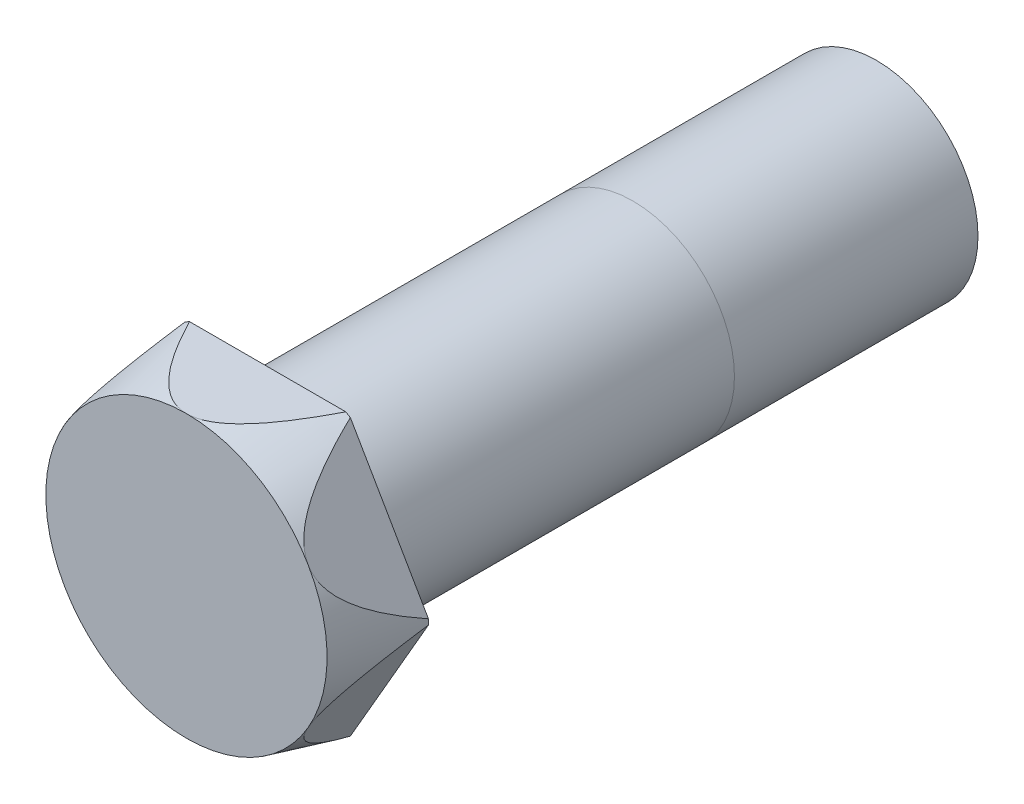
ISO-10303-21;
HEADER;
FILE_DESCRIPTION(('STEP AP214'),'2;1');
FILE_NAME('part.step','',(''),(''),'','','');
FILE_SCHEMA(('AUTOMOTIVE_DESIGN { 1 0 10303 214 1 1 1 1 }'));
ENDSEC;
DATA;
#1=APPLICATION_CONTEXT('core data for automotive mechanical design processes');
#2=APPLICATION_PROTOCOL_DEFINITION('international standard','automotive_design',2000,#1);
#3=PRODUCT_CONTEXT('',#1,'mechanical');
#4=PRODUCT('Part','Part','',(#3));
#5=PRODUCT_RELATED_PRODUCT_CATEGORY('part','',(#4));
#6=PRODUCT_DEFINITION_FORMATION('','',#4);
#7=PRODUCT_DEFINITION_CONTEXT('part definition',#1,'design');
#8=PRODUCT_DEFINITION('design','',#6,#7);
#9=PRODUCT_DEFINITION_SHAPE('','',#8);
#10=(LENGTH_UNIT() NAMED_UNIT(*) SI_UNIT(.MILLI.,.METRE.));
#11=(NAMED_UNIT(*) PLANE_ANGLE_UNIT() SI_UNIT($,.RADIAN.));
#12=(NAMED_UNIT(*) SI_UNIT($,.STERADIAN.) SOLID_ANGLE_UNIT());
#13=UNCERTAINTY_MEASURE_WITH_UNIT(LENGTH_MEASURE(1.E-05),#10,'distance_accuracy_value','');
#14=(GEOMETRIC_REPRESENTATION_CONTEXT(3) GLOBAL_UNCERTAINTY_ASSIGNED_CONTEXT((#13)) GLOBAL_UNIT_ASSIGNED_CONTEXT((#10,
#11,#12)) REPRESENTATION_CONTEXT('',''));
#15=CARTESIAN_POINT('',(0.,0.,0.));
#16=DIRECTION('',(0.,0.,1.));
#17=DIRECTION('',(1.,0.,0.));
#18=AXIS2_PLACEMENT_3D('',#15,#16,#17);
#19=CARTESIAN_POINT('',(0.,0.,-19.05));
#20=DIRECTION('',(0.,0.,1.));
#21=DIRECTION('',(1.,0.,0.));
#22=AXIS2_PLACEMENT_3D('',#19,#20,#21);
#23=CYLINDRICAL_SURFACE('',#22,3.175);
#24=CARTESIAN_POINT('',(0.,0.,0.));
#25=DIRECTION('',(0.,0.,-1.));
#26=DIRECTION('',(-1.,0.,0.));
#27=AXIS2_PLACEMENT_3D('',#24,#25,#26);
#28=CIRCLE('',#27,3.175);
#29=CARTESIAN_POINT('',(-3.175,0.,0.));
#30=VERTEX_POINT('',#29);
#31=EDGE_CURVE('E131',#30,#30,#28,.T.);
#32=ORIENTED_EDGE('',*,*,#31,.T.);
#33=EDGE_LOOP('',(#32));
#34=FACE_BOUND('',#33,.T.);
#35=CARTESIAN_POINT('',(0.,0.,-11.43));
#36=DIRECTION('',(0.,0.,-1.));
#37=DIRECTION('',(-1.,0.,0.));
#38=AXIS2_PLACEMENT_3D('',#35,#36,#37);
#39=CIRCLE('',#38,3.175);
#40=CARTESIAN_POINT('',(-3.175,0.,-11.43));
#41=VERTEX_POINT('',#40);
#42=CARTESIAN_POINT('',(3.175,0.,-11.43));
#43=VERTEX_POINT('',#42);
#44=EDGE_CURVE('E12',#41,#43,#39,.T.);
#45=ORIENTED_EDGE('',*,*,#44,.F.);
#46=EDGE_CURVE('E49',#43,#41,#39,.T.);
#47=ORIENTED_EDGE('',*,*,#46,.F.);
#48=EDGE_LOOP('',(#45,#47));
#49=FACE_BOUND('',#48,.T.);
#50=ADVANCED_FACE('F44',(#34,#49),#23,.T.);
#51=CARTESIAN_POINT('',(2.54,4.39940905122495,2.54));
#52=DIRECTION('',(0.,-1.,0.));
#53=DIRECTION('',(0.,0.,-1.));
#54=AXIS2_PLACEMENT_3D('',#51,#52,#53);
#55=PLANE('',#54);
#56=CARTESIAN_POINT('',(-5.0224568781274,4.39940905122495,-6.59418072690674));
#57=CARTESIAN_POINT('',(-4.92492659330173,4.39940905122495,-6.30000684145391));
#58=CARTESIAN_POINT('',(-4.82632688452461,4.39940905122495,-6.00618212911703));
#59=CARTESIAN_POINT('',(-4.62646166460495,4.39940905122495,-5.41937920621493));
#60=CARTESIAN_POINT('',(-4.52519564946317,4.39940905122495,-5.12640116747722));
#61=CARTESIAN_POINT('',(-4.31869697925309,4.39940905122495,-4.53924697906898));
#62=CARTESIAN_POINT('',(-4.21343934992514,4.39940905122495,-4.24507958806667));
#63=CARTESIAN_POINT('',(-3.9989975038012,4.39940905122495,-3.65821844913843));
#64=CARTESIAN_POINT('',(-3.8898137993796,4.39940905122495,-3.36552451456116));
#65=CARTESIAN_POINT('',(-3.65349559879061,4.39940905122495,-2.7479996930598));
#66=CARTESIAN_POINT('',(-3.52575243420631,4.39940905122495,-2.42340088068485));
#67=CARTESIAN_POINT('',(-3.26206361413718,4.39940905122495,-1.77735138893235));
#68=CARTESIAN_POINT('',(-3.12611450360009,4.39940905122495,-1.45590210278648));
#69=CARTESIAN_POINT('',(-2.91390286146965,4.39940905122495,-0.978126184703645));
#70=CARTESIAN_POINT('',(-2.84192837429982,4.39940905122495,-0.819895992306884));
#71=CARTESIAN_POINT('',(-2.69453597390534,4.39940905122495,-0.505051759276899));
#72=CARTESIAN_POINT('',(-2.61911828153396,4.39940905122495,-0.34843761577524));
#73=CARTESIAN_POINT('',(-2.46410270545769,4.39940905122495,-0.0374256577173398));
#74=CARTESIAN_POINT('',(-2.38450787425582,4.39940905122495,0.11697367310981));
#75=CARTESIAN_POINT('',(-2.22000581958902,4.39940905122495,0.422903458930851));
#76=CARTESIAN_POINT('',(-2.13509984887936,4.39940905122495,0.574434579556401));
#77=CARTESIAN_POINT('',(-2.01245666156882,4.39940905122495,0.781910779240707));
#78=CARTESIAN_POINT('',(-1.97765624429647,4.39940905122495,0.839594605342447));
#79=CARTESIAN_POINT('',(-1.90688170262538,4.39940905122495,0.954239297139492));
#80=CARTESIAN_POINT('',(-1.87090753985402,4.39940905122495,1.01120013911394));
#81=CARTESIAN_POINT('',(-1.76095767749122,4.39940905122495,1.1809149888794));
#82=CARTESIAN_POINT('',(-1.68500778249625,4.39940905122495,1.29241027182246));
#83=CARTESIAN_POINT('',(-1.5270597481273,4.39940905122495,1.5096168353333));
#84=CARTESIAN_POINT('',(-1.4451190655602,4.39940905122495,1.61536951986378));
#85=CARTESIAN_POINT('',(-1.27264269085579,4.39940905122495,1.81953561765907));
#86=CARTESIAN_POINT('',(-1.18212048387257,4.39940905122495,1.91796012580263));
#87=CARTESIAN_POINT('',(-1.0044145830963,4.39940905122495,2.08875646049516));
#88=CARTESIAN_POINT('',(-0.918869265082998,4.39940905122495,2.1628051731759));
#89=CARTESIAN_POINT('',(-0.737661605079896,4.39940905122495,2.2972180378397));
#90=CARTESIAN_POINT('',(-0.64204350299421,4.39940905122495,2.35763864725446));
#91=CARTESIAN_POINT('',(-0.48000050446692,4.39940905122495,2.43693920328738));
#92=CARTESIAN_POINT('',(-0.4170357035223,4.39940905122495,2.46279077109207));
#93=CARTESIAN_POINT('',(-0.287766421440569,4.39940905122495,2.50417394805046));
#94=CARTESIAN_POINT('',(-0.221465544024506,4.39940905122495,2.51971644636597));
#95=CARTESIAN_POINT('',(-0.0865866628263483,4.39940905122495,2.53866184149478));
#96=CARTESIAN_POINT('',(-0.0179954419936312,4.39940905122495,2.54197408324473));
#97=CARTESIAN_POINT('',(0.118599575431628,4.39940905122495,2.5357192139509));
#98=CARTESIAN_POINT('',(0.186603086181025,4.39940905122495,2.52614615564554));
#99=CARTESIAN_POINT('',(0.328881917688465,4.39940905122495,2.49336179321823));
#100=CARTESIAN_POINT('',(0.402763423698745,4.39940905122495,2.4684827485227));
#101=CARTESIAN_POINT('',(0.545504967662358,4.39940905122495,2.40716402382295));
#102=CARTESIAN_POINT('',(0.614355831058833,4.39940905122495,2.37070383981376));
#103=CARTESIAN_POINT('',(0.793054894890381,4.39940905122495,2.26117087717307));
#104=CARTESIAN_POINT('',(0.898055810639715,4.39940905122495,2.1802851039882));
#105=CARTESIAN_POINT('',(1.04629604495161,4.39940905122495,2.0488712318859));
#106=CARTESIAN_POINT('',(1.09426243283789,4.39940905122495,2.00327276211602));
#107=CARTESIAN_POINT('',(1.18750427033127,4.39940905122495,1.90939889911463));
#108=CARTESIAN_POINT('',(1.23278066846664,4.39940905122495,1.86112446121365));
#109=CARTESIAN_POINT('',(1.34904393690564,4.39940905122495,1.73115595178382));
#110=CARTESIAN_POINT('',(1.41807649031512,4.39940905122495,1.64772683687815));
#111=CARTESIAN_POINT('',(1.55120360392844,4.39940905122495,1.47699146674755));
#112=CARTESIAN_POINT('',(1.61529530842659,4.39940905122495,1.38968301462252));
#113=CARTESIAN_POINT('',(1.73958205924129,4.39940905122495,1.21209328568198));
#114=CARTESIAN_POINT('',(1.79976909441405,4.39940905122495,1.1218064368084));
#115=CARTESIAN_POINT('',(1.91683276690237,4.39940905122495,0.939104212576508));
#116=CARTESIAN_POINT('',(1.97370882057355,4.39940905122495,0.846688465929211));
#117=CARTESIAN_POINT('',(2.1414408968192,4.39940905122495,0.56495860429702));
#118=CARTESIAN_POINT('',(2.24806908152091,4.39940905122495,0.373125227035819));
#119=CARTESIAN_POINT('',(2.40187368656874,4.39940905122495,0.082372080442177));
#120=CARTESIAN_POINT('',(2.45208797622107,4.39940905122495,-0.0149812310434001));
#121=CARTESIAN_POINT('',(2.55075505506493,4.39940905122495,-0.210575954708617));
#122=CARTESIAN_POINT('',(2.59920790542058,4.39940905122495,-0.30881733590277));
#123=CARTESIAN_POINT('',(2.75513907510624,4.39940905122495,-0.631220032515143));
#124=CARTESIAN_POINT('',(2.85946172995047,4.39940905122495,-0.856907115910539));
#125=CARTESIAN_POINT('',(3.06219870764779,4.39940905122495,-1.31093040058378));
#126=CARTESIAN_POINT('',(3.16061223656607,4.39940905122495,-1.53926695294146));
#127=CARTESIAN_POINT('',(3.35283568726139,4.39940905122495,-1.99797469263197));
#128=CARTESIAN_POINT('',(3.44664368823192,4.39940905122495,-2.22834668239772));
#129=CARTESIAN_POINT('',(3.63051995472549,4.39940905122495,-2.6905815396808));
#130=CARTESIAN_POINT('',(3.72058808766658,4.39940905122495,-2.92244445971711));
#131=CARTESIAN_POINT('',(3.98666935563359,4.39940905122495,-3.62094104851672));
#132=CARTESIAN_POINT('',(4.15808351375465,4.39940905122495,-4.08932555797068));
#133=CARTESIAN_POINT('',(4.49225226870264,4.39940905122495,-5.02901397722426));
#134=CARTESIAN_POINT('',(4.65500897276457,4.39940905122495,-5.50031714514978));
#135=CARTESIAN_POINT('',(4.95837619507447,4.39940905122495,-6.39854580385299));
#136=CARTESIAN_POINT('',(5.09958875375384,4.39940905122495,-6.82526856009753));
#137=CARTESIAN_POINT('',(5.37790122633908,4.39940905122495,-7.68008556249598));
#138=CARTESIAN_POINT('',(5.51500082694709,4.39940905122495,-8.10817991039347));
#139=CARTESIAN_POINT('',(5.78523289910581,4.39940905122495,-8.96336437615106));
#140=CARTESIAN_POINT('',(5.91838121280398,4.39940905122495,-9.39044949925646));
#141=CARTESIAN_POINT('',(6.18193168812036,4.39940905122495,-10.2454160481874));
#142=CARTESIAN_POINT('',(6.31233414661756,4.39940905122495,-10.6732973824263));
#143=CARTESIAN_POINT('',(6.44164870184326,4.39940905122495,-11.1015031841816));
#144=B_SPLINE_CURVE_WITH_KNOTS('',3,(#56,#57,#58,#59,#60,#61,#62,#63,#64,#65,#66,#67,#68,#69,
#70,#71,#72,#73,#74,#75,#76,#77,#78,#79,#80,#81,#82,#83,#84,#85,#86,#87,#88,#89,#90,#91,#92,#93,
#94,#95,#96,#97,#98,#99,#100,#101,#102,#103,#104,#105,#106,#107,#108,#109,#110,#111,#112,#113,
#114,#115,#116,#117,#118,#119,#120,#121,#122,#123,#124,#125,#126,#127,#128,#129,#130,#131,#132,
#133,#134,#135,#136,#137,#138,#139,#140,#141,#142,#143),.UNSPECIFIED.,.F.,.F.,(4,2,2,2,2,2,2,2,
2,2,2,2,2,2,2,2,2,2,2,2,2,2,2,2,2,2,2,2,2,2,2,2,2,2,2,2,2,2,2,2,2,2,2,4),(0.,0.929765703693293,
1.85970843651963,2.79698115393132,3.73413199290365,4.78055216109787,5.82741603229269,
6.34887710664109,6.87030478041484,7.39135658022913,7.91228593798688,8.11437849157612,
8.31647765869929,8.72099206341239,9.12203729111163,9.5224624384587,9.86112948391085,
10.1983666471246,10.40186856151,10.6051551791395,10.8099456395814,11.0148306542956,
11.2473945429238,11.4803724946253,11.8756260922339,12.0741398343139,12.2725831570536,
12.5971869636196,12.921976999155,13.2474136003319,13.5729073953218,14.2309995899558,
14.559614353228,14.8882176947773,15.6339851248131,16.3798525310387,17.1260284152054,
17.872230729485,19.368387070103,20.864177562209,22.2125946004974,23.5611140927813,
24.9031816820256,26.245103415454),.UNSPECIFIED.);
#145=CARTESIAN_POINT('',(2.44403175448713,4.39940905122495,0.));
#146=VERTEX_POINT('',#145);
#147=CARTESIAN_POINT('',(0.,4.39940905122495,2.54));
#148=VERTEX_POINT('',#147);
#149=EDGE_CURVE('E183',#146,#148,#144,.F.);
#150=ORIENTED_EDGE('',*,*,#149,.F.);
#151=DIRECTION('',(-1.,0.,0.));
#152=VECTOR('',#151,1.);
#153=CARTESIAN_POINT('',(2.54,4.39940905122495,0.));
#154=LINE('',#153,#152);
#155=CARTESIAN_POINT('',(-2.44403175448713,4.39940905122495,0.));
#156=VERTEX_POINT('',#155);
#157=EDGE_CURVE('E165',#146,#156,#154,.T.);
#158=ORIENTED_EDGE('',*,*,#157,.T.);
#159=EDGE_CURVE('E173',#148,#156,#144,.F.);
#160=ORIENTED_EDGE('',*,*,#159,.F.);
#161=EDGE_LOOP('',(#150,#158,#160));
#162=FACE_BOUND('',#161,.T.);
#163=ADVANCED_FACE('F46',(#162),#55,.F.);
#164=CARTESIAN_POINT('',(-2.54,4.39940905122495,2.54));
#165=DIRECTION('',(0.866025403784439,-0.499999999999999,0.));
#166=DIRECTION('',(0.499999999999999,0.866025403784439,0.));
#167=AXIS2_PLACEMENT_3D('',#164,#165,#166);
#168=PLANE('',#167);
#169=CARTESIAN_POINT('',(-2.58793278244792,4.31638703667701,-0.000200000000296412));
#170=CARTESIAN_POINT('',(-2.62052702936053,4.25993214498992,0.126647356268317));
#171=CARTESIAN_POINT('',(-2.65386737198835,4.20218497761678,0.252767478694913));
#172=CARTESIAN_POINT('',(-2.7225443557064,4.08323295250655,0.503119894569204));
#173=CARTESIAN_POINT('',(-2.75788466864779,4.02202173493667,0.627348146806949));
#174=CARTESIAN_POINT('',(-2.83130515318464,3.89485372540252,0.874206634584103));
#175=CARTESIAN_POINT('',(-2.86940889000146,3.82885611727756,0.996809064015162));
#176=CARTESIAN_POINT('',(-2.94869432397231,3.69152971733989,1.23787615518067));
#177=CARTESIAN_POINT('',(-2.98987347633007,3.62020533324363,1.35634412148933));
#178=CARTESIAN_POINT('',(-3.07176250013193,3.4783693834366,1.57510364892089));
#179=CARTESIAN_POINT('',(-3.11206665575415,3.40856053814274,1.67599681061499));
#180=CARTESIAN_POINT('',(-3.19696055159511,3.26151999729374,1.87049181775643));
#181=CARTESIAN_POINT('',(-3.2415501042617,3.18428862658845,1.96409398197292));
#182=CARTESIAN_POINT('',(-3.32850607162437,3.03367647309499,2.12487260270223));
#183=CARTESIAN_POINT('',(-3.37002148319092,2.9617696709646,2.19385959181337));
#184=CARTESIAN_POINT('',(-3.4577839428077,2.80976063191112,2.31856984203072));
#185=CARTESIAN_POINT('',(-3.50401405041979,2.72968773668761,2.37433835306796));
#186=CARTESIAN_POINT('',(-3.58321092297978,2.59251472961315,2.44812735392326));
#187=CARTESIAN_POINT('',(-3.61468468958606,2.53800056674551,2.4724673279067));
#188=CARTESIAN_POINT('',(-3.67918692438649,2.42627941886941,2.51070124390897));
#189=CARTESIAN_POINT('',(-3.71221328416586,2.3690760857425,2.52460894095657));
#190=CARTESIAN_POINT('',(-3.77922910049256,2.25300128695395,2.54032716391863));
#191=CARTESIAN_POINT('',(-3.81322352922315,2.19412120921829,2.54205596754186));
#192=CARTESIAN_POINT('',(-3.88078453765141,2.07710211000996,2.53295103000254));
#193=CARTESIAN_POINT('',(-3.91435092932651,2.01896341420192,2.52211194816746));
#194=CARTESIAN_POINT('',(-3.98560600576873,1.8955460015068,2.48653621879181));
#195=CARTESIAN_POINT('',(-4.0230342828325,1.83071832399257,2.4597627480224));
#196=CARTESIAN_POINT('',(-4.09525956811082,1.70562046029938,2.39459553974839));
#197=CARTESIAN_POINT('',(-4.13005096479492,1.64535999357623,2.35617784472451));
#198=CARTESIAN_POINT('',(-4.19235139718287,1.53745247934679,2.27688446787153));
#199=CARTESIAN_POINT('',(-4.22020538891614,1.48920795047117,2.23706501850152));
#200=CARTESIAN_POINT('',(-4.27411363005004,1.39583613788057,2.15277718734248));
#201=CARTESIAN_POINT('',(-4.30016634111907,1.3507115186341,2.10830491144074));
#202=CARTESIAN_POINT('',(-4.35086481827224,1.26289918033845,2.01552716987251));
#203=CARTESIAN_POINT('',(-4.37549796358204,1.22023332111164,1.96719440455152));
#204=CARTESIAN_POINT('',(-4.42334430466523,1.13736102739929,1.86785436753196));
#205=CARTESIAN_POINT('',(-4.4465580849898,1.09715358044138,1.81684821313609));
#206=CARTESIAN_POINT('',(-4.49852571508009,1.00714300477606,1.69719255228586));
#207=CARTESIAN_POINT('',(-4.52686370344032,0.958060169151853,1.62782307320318));
#208=CARTESIAN_POINT('',(-4.58184771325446,0.862825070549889,1.4864398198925));
#209=CARTESIAN_POINT('',(-4.6084931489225,0.816673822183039,1.4144251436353));
#210=CARTESIAN_POINT('',(-4.68641632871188,0.681706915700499,1.19509358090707));
#211=CARTESIAN_POINT('',(-4.73556821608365,0.596573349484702,1.0447596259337));
#212=CARTESIAN_POINT('',(-4.82749773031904,0.437346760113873,0.746496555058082));
#213=CARTESIAN_POINT('',(-4.87046834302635,0.362919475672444,0.598800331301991));
#214=CARTESIAN_POINT('',(-4.93267756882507,0.255169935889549,0.375274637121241));
#215=CARTESIAN_POINT('',(-4.95298997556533,0.219987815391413,0.300631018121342));
#216=CARTESIAN_POINT('',(-4.99298247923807,0.150718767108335,0.150685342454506));
#217=CARTESIAN_POINT('',(-5.01266268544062,0.116631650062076,0.0753834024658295));
#218=CARTESIAN_POINT('',(-5.03206721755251,0.0830220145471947,-0.000199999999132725));
#219=B_SPLINE_CURVE_WITH_KNOTS('',3,(#169,#170,#171,#172,#173,#174,#175,#176,#177,#178,#179,
#180,#181,#182,#183,#184,#185,#186,#187,#188,#189,#190,#191,#192,#193,#194,#195,#196,#197,#198,
#199,#200,#201,#202,#203,#204,#205,#206,#207,#208,#209,#210,#211,#212,#213,#214,#215,#216,#217,
#218),.UNSPECIFIED.,.F.,.F.,(4,2,2,2,2,2,2,2,2,2,2,2,2,2,2,2,2,2,2,2,2,2,2,2,4),(0.,
0.42789655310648,0.856605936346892,1.28953945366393,1.72211862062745,2.10922463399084,
2.49631371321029,2.81941329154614,3.14139031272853,3.34314445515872,3.54463211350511,
3.74747050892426,3.95039513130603,4.1875686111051,4.42523341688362,4.63036695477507,
4.8356735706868,5.04258854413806,5.2494177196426,5.51801453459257,5.78670380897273,
6.325135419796,6.8376349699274,7.09257220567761,7.3474651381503),.UNSPECIFIED.);
#220=CARTESIAN_POINT('',(-2.58798412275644,4.31629811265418,0.));
#221=VERTEX_POINT('',#220);
#222=CARTESIAN_POINT('',(-3.81,2.19970452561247,2.54));
#223=VERTEX_POINT('',#222);
#224=EDGE_CURVE('E182',#221,#223,#219,.T.);
#225=ORIENTED_EDGE('',*,*,#224,.F.);
#226=DIRECTION('',(-0.499999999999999,-0.866025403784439,0.));
#227=VECTOR('',#226,1.);
#228=CARTESIAN_POINT('',(-2.54,4.39940905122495,0.));
#229=LINE('',#228,#227);
#230=CARTESIAN_POINT('',(-5.03201587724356,0.0831109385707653,0.));
#231=VERTEX_POINT('',#230);
#232=EDGE_CURVE('E161',#221,#231,#229,.T.);
#233=ORIENTED_EDGE('',*,*,#232,.T.);
#234=EDGE_CURVE('E174',#223,#231,#219,.T.);
#235=ORIENTED_EDGE('',*,*,#234,.F.);
#236=EDGE_LOOP('',(#225,#233,#235));
#237=FACE_BOUND('',#236,.T.);
#238=ADVANCED_FACE('F189',(#237),#168,.F.);
#239=CARTESIAN_POINT('',(-5.08,0.,2.54));
#240=DIRECTION('',(0.866025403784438,0.5,0.));
#241=DIRECTION('',(-0.5,0.866025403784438,0.));
#242=AXIS2_PLACEMENT_3D('',#239,#240,#241);
#243=PLANE('',#242);
#244=CARTESIAN_POINT('',(-5.03206721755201,-0.0830220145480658,-0.000200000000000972));
#245=CARTESIAN_POINT('',(-4.99947297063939,-0.139476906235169,0.126647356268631));
#246=CARTESIAN_POINT('',(-4.96613262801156,-0.197224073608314,0.252767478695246));
#247=CARTESIAN_POINT('',(-4.8974556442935,-0.316176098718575,0.503119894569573));
#248=CARTESIAN_POINT('',(-4.8621153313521,-0.377387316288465,0.627348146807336));
#249=CARTESIAN_POINT('',(-4.78869484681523,-0.504555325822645,0.874206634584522));
#250=CARTESIAN_POINT('',(-4.75059110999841,-0.570552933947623,0.996809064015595));
#251=CARTESIAN_POINT('',(-4.67130567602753,-0.707879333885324,1.23787615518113));
#252=CARTESIAN_POINT('',(-4.63012652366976,-0.779203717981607,1.35634412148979));
#253=CARTESIAN_POINT('',(-4.54823749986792,-0.921039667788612,1.57510364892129));
#254=CARTESIAN_POINT('',(-4.50793334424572,-0.99084851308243,1.6759968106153));
#255=CARTESIAN_POINT('',(-4.42303944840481,-1.13788905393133,1.87049181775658));
#256=CARTESIAN_POINT('',(-4.37844989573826,-1.21512042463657,1.96409398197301));
#257=CARTESIAN_POINT('',(-4.29149392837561,-1.36573257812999,2.12487260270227));
#258=CARTESIAN_POINT('',(-4.24997851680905,-1.4376393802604,2.19385959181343));
#259=CARTESIAN_POINT('',(-4.16221605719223,-1.58964841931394,2.31856984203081));
#260=CARTESIAN_POINT('',(-4.11598594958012,-1.66972131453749,2.37433835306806));
#261=CARTESIAN_POINT('',(-4.03678907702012,-1.80689432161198,2.44812735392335));
#262=CARTESIAN_POINT('',(-4.00531531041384,-1.86140848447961,2.47246732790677));
#263=CARTESIAN_POINT('',(-3.94081307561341,-1.9731296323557,2.51070124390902));
#264=CARTESIAN_POINT('',(-3.90778671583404,-2.03033296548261,2.52460894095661));
#265=CARTESIAN_POINT('',(-3.84077089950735,-2.14640776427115,2.54032716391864));
#266=CARTESIAN_POINT('',(-3.80677647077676,-2.2052878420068,2.54205596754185));
#267=CARTESIAN_POINT('',(-3.73921546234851,-2.32230694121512,2.53295103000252));
#268=CARTESIAN_POINT('',(-3.70564907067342,-2.38044563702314,2.52211194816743));
#269=CARTESIAN_POINT('',(-3.6343939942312,-2.50386304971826,2.48653621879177));
#270=CARTESIAN_POINT('',(-3.59696571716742,-2.56869072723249,2.45976274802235));
#271=CARTESIAN_POINT('',(-3.5247404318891,-2.6937885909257,2.39459553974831));
#272=CARTESIAN_POINT('',(-3.489949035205,-2.75404905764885,2.35617784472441));
#273=CARTESIAN_POINT('',(-3.42764860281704,-2.8619565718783,2.27688446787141));
#274=CARTESIAN_POINT('',(-3.39979461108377,-2.91020110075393,2.23706501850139));
#275=CARTESIAN_POINT('',(-3.34588636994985,-3.00357291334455,2.15277718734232));
#276=CARTESIAN_POINT('',(-3.31983365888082,-3.04869753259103,2.10830491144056));
#277=CARTESIAN_POINT('',(-3.26913518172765,-3.13650987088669,2.01552716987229));
#278=CARTESIAN_POINT('',(-3.24450203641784,-3.17917573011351,1.96719440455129));
#279=CARTESIAN_POINT('',(-3.19665569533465,-3.26204802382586,1.8678543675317));
#280=CARTESIAN_POINT('',(-3.17344191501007,-3.30225547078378,1.81684821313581));
#281=CARTESIAN_POINT('',(-3.12147428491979,-3.39226604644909,1.69719255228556));
#282=CARTESIAN_POINT('',(-3.09313629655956,-3.4413488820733,1.62782307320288));
#283=CARTESIAN_POINT('',(-3.03815228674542,-3.53658398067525,1.4864398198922));
#284=CARTESIAN_POINT('',(-3.01150685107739,-3.5827352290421,1.414425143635));
#285=CARTESIAN_POINT('',(-2.93358367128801,-3.71770213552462,1.19509358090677));
#286=CARTESIAN_POINT('',(-2.88443178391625,-3.80283570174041,1.0447596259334));
#287=CARTESIAN_POINT('',(-2.79250226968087,-3.96206229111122,0.746496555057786));
#288=CARTESIAN_POINT('',(-2.74953165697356,-4.03648957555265,0.598800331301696));
#289=CARTESIAN_POINT('',(-2.68732243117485,-4.14423911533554,0.375274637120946));
#290=CARTESIAN_POINT('',(-2.66701002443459,-4.17942123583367,0.300631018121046));
#291=CARTESIAN_POINT('',(-2.62701752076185,-4.24869028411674,0.15068534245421));
#292=CARTESIAN_POINT('',(-2.60733731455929,-4.282777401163,0.0753834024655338));
#293=CARTESIAN_POINT('',(-2.58793278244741,-4.31638703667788,-0.000199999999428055));
#294=B_SPLINE_CURVE_WITH_KNOTS('',3,(#244,#245,#246,#247,#248,#249,#250,#251,#252,#253,#254,
#255,#256,#257,#258,#259,#260,#261,#262,#263,#264,#265,#266,#267,#268,#269,#270,#271,#272,#273,
#274,#275,#276,#277,#278,#279,#280,#281,#282,#283,#284,#285,#286,#287,#288,#289,#290,#291,#292,
#293),.UNSPECIFIED.,.F.,.F.,(4,2,2,2,2,2,2,2,2,2,2,2,2,2,2,2,2,2,2,2,2,2,2,2,4),(0.,
0.427896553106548,0.856605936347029,1.28953945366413,1.72211862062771,2.10922463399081,
2.49631371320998,2.81941329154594,3.14139031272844,3.3431444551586,3.54463211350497,
3.74747050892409,3.95039513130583,4.18756861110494,4.42523341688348,4.63036695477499,
4.83567357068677,5.04258854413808,5.24941771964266,5.51801453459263,5.78670380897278,
6.32513541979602,6.83763496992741,7.09257220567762,7.34746513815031),.UNSPECIFIED.);
#295=CARTESIAN_POINT('',(-5.03201587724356,-0.083110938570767,0.));
#296=VERTEX_POINT('',#295);
#297=CARTESIAN_POINT('',(-3.81,-2.19970452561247,2.54));
#298=VERTEX_POINT('',#297);
#299=EDGE_CURVE('E231',#296,#298,#294,.T.);
#300=ORIENTED_EDGE('',*,*,#299,.F.);
#301=DIRECTION('',(0.5,-0.866025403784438,0.));
#302=VECTOR('',#301,1.);
#303=CARTESIAN_POINT('',(-5.08,0.,0.));
#304=LINE('',#303,#302);
#305=CARTESIAN_POINT('',(-2.58798412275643,-4.31629811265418,0.));
#306=VERTEX_POINT('',#305);
#307=EDGE_CURVE('E157',#296,#306,#304,.T.);
#308=ORIENTED_EDGE('',*,*,#307,.T.);
#309=EDGE_CURVE('E225',#298,#306,#294,.T.);
#310=ORIENTED_EDGE('',*,*,#309,.F.);
#311=EDGE_LOOP('',(#300,#308,#310));
#312=FACE_BOUND('',#311,.T.);
#313=ADVANCED_FACE('F233',(#312),#243,.F.);
#314=CARTESIAN_POINT('',(-2.54,-4.39940905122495,2.54));
#315=DIRECTION('',(0.,1.,0.));
#316=DIRECTION('',(0.,0.,1.));
#317=AXIS2_PLACEMENT_3D('',#314,#315,#316);
#318=PLANE('',#317);
#319=CARTESIAN_POINT('',(-5.0224568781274,-4.39940905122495,-6.59418072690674));
#320=CARTESIAN_POINT('',(-4.92492659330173,-4.39940905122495,-6.30000684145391));
#321=CARTESIAN_POINT('',(-4.82632688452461,-4.39940905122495,-6.00618212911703));
#322=CARTESIAN_POINT('',(-4.62646166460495,-4.39940905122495,-5.41937920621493));
#323=CARTESIAN_POINT('',(-4.52519564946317,-4.39940905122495,-5.12640116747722));
#324=CARTESIAN_POINT('',(-4.31869697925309,-4.39940905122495,-4.53924697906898));
#325=CARTESIAN_POINT('',(-4.21343934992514,-4.39940905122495,-4.24507958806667));
#326=CARTESIAN_POINT('',(-3.9989975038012,-4.39940905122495,-3.65821844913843));
#327=CARTESIAN_POINT('',(-3.88981379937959,-4.39940905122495,-3.36552451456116));
#328=CARTESIAN_POINT('',(-3.65349559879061,-4.39940905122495,-2.7479996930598));
#329=CARTESIAN_POINT('',(-3.52575243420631,-4.39940905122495,-2.42340088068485));
#330=CARTESIAN_POINT('',(-3.26206361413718,-4.39940905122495,-1.77735138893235));
#331=CARTESIAN_POINT('',(-3.12611450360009,-4.39940905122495,-1.45590210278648));
#332=CARTESIAN_POINT('',(-2.91390286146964,-4.39940905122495,-0.978126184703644));
#333=CARTESIAN_POINT('',(-2.84192837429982,-4.39940905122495,-0.819895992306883));
#334=CARTESIAN_POINT('',(-2.69453597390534,-4.39940905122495,-0.505051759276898));
#335=CARTESIAN_POINT('',(-2.61911828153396,-4.39940905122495,-0.348437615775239));
#336=CARTESIAN_POINT('',(-2.46410270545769,-4.39940905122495,-0.0374256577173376));
#337=CARTESIAN_POINT('',(-2.38450787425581,-4.39940905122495,0.116973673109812));
#338=CARTESIAN_POINT('',(-2.22000581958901,-4.39940905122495,0.422903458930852));
#339=CARTESIAN_POINT('',(-2.13509984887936,-4.39940905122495,0.574434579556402));
#340=CARTESIAN_POINT('',(-2.01245666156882,-4.39940905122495,0.781910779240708));
#341=CARTESIAN_POINT('',(-1.97765624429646,-4.39940905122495,0.839594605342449));
#342=CARTESIAN_POINT('',(-1.90688170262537,-4.39940905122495,0.954239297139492));
#343=CARTESIAN_POINT('',(-1.87090753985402,-4.39940905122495,1.01120013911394));
#344=CARTESIAN_POINT('',(-1.76095767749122,-4.39940905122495,1.1809149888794));
#345=CARTESIAN_POINT('',(-1.68500778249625,-4.39940905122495,1.29241027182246));
#346=CARTESIAN_POINT('',(-1.5270597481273,-4.39940905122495,1.5096168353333));
#347=CARTESIAN_POINT('',(-1.44511906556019,-4.39940905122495,1.61536951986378));
#348=CARTESIAN_POINT('',(-1.27264269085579,-4.39940905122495,1.81953561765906));
#349=CARTESIAN_POINT('',(-1.18212048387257,-4.39940905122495,1.91796012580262));
#350=CARTESIAN_POINT('',(-1.0044145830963,-4.39940905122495,2.08875646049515));
#351=CARTESIAN_POINT('',(-0.918869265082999,-4.39940905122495,2.1628051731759));
#352=CARTESIAN_POINT('',(-0.737661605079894,-4.39940905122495,2.2972180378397));
#353=CARTESIAN_POINT('',(-0.642043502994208,-4.39940905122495,2.35763864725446));
#354=CARTESIAN_POINT('',(-0.480000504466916,-4.39940905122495,2.43693920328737));
#355=CARTESIAN_POINT('',(-0.417035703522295,-4.39940905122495,2.46279077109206));
#356=CARTESIAN_POINT('',(-0.287766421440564,-4.39940905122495,2.50417394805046));
#357=CARTESIAN_POINT('',(-0.221465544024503,-4.39940905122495,2.51971644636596));
#358=CARTESIAN_POINT('',(-0.0865866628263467,-4.39940905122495,2.53866184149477));
#359=CARTESIAN_POINT('',(-0.0179954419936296,-4.39940905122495,2.54197408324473));
#360=CARTESIAN_POINT('',(0.11859957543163,-4.39940905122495,2.53571921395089));
#361=CARTESIAN_POINT('',(0.186603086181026,-4.39940905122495,2.52614615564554));
#362=CARTESIAN_POINT('',(0.328881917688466,-4.39940905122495,2.49336179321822));
#363=CARTESIAN_POINT('',(0.402763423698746,-4.39940905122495,2.46848274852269));
#364=CARTESIAN_POINT('',(0.545504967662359,-4.39940905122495,2.40716402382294));
#365=CARTESIAN_POINT('',(0.614355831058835,-4.39940905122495,2.37070383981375));
#366=CARTESIAN_POINT('',(0.793054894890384,-4.39940905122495,2.26117087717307));
#367=CARTESIAN_POINT('',(0.898055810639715,-4.39940905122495,2.18028510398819));
#368=CARTESIAN_POINT('',(1.04629604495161,-4.39940905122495,2.04887123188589));
#369=CARTESIAN_POINT('',(1.09426243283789,-4.39940905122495,2.00327276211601));
#370=CARTESIAN_POINT('',(1.18750427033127,-4.39940905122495,1.90939889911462));
#371=CARTESIAN_POINT('',(1.23278066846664,-4.39940905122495,1.86112446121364));
#372=CARTESIAN_POINT('',(1.34904393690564,-4.39940905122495,1.7311559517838));
#373=CARTESIAN_POINT('',(1.41807649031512,-4.39940905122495,1.64772683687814));
#374=CARTESIAN_POINT('',(1.55120360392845,-4.39940905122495,1.47699146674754));
#375=CARTESIAN_POINT('',(1.61529530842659,-4.39940905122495,1.3896830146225));
#376=CARTESIAN_POINT('',(1.73958205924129,-4.39940905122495,1.21209328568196));
#377=CARTESIAN_POINT('',(1.79976909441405,-4.39940905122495,1.12180643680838));
#378=CARTESIAN_POINT('',(1.91683276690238,-4.39940905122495,0.939104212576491));
#379=CARTESIAN_POINT('',(1.97370882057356,-4.39940905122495,0.846688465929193));
#380=CARTESIAN_POINT('',(2.14144089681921,-4.39940905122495,0.564958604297));
#381=CARTESIAN_POINT('',(2.24806908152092,-4.39940905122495,0.373125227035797));
#382=CARTESIAN_POINT('',(2.40187368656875,-4.39940905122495,0.0823720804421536));
#383=CARTESIAN_POINT('',(2.45208797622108,-4.39940905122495,-0.0149812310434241));
#384=CARTESIAN_POINT('',(2.55075505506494,-4.39940905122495,-0.210575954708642));
#385=CARTESIAN_POINT('',(2.59920790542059,-4.39940905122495,-0.308817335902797));
#386=CARTESIAN_POINT('',(2.75513907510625,-4.39940905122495,-0.63122003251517));
#387=CARTESIAN_POINT('',(2.85946172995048,-4.39940905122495,-0.856907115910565));
#388=CARTESIAN_POINT('',(3.0621987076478,-4.39940905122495,-1.3109304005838));
#389=CARTESIAN_POINT('',(3.16061223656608,-4.39940905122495,-1.53926695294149));
#390=CARTESIAN_POINT('',(3.35283568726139,-4.39940905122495,-1.997974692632));
#391=CARTESIAN_POINT('',(3.44664368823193,-4.39940905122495,-2.22834668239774));
#392=CARTESIAN_POINT('',(3.6305199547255,-4.39940905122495,-2.69058153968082));
#393=CARTESIAN_POINT('',(3.72058808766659,-4.39940905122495,-2.92244445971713));
#394=CARTESIAN_POINT('',(3.9866693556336,-4.39940905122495,-3.62094104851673));
#395=CARTESIAN_POINT('',(4.15808351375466,-4.39940905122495,-4.08932555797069));
#396=CARTESIAN_POINT('',(4.49225226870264,-4.39940905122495,-5.02901397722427));
#397=CARTESIAN_POINT('',(4.65500897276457,-4.39940905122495,-5.50031714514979));
#398=CARTESIAN_POINT('',(4.95837619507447,-4.39940905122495,-6.398545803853));
#399=CARTESIAN_POINT('',(5.09958875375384,-4.39940905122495,-6.82526856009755));
#400=CARTESIAN_POINT('',(5.37790122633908,-4.39940905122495,-7.680085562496));
#401=CARTESIAN_POINT('',(5.5150008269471,-4.39940905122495,-8.10817991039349));
#402=CARTESIAN_POINT('',(5.78523289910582,-4.39940905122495,-8.96336437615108));
#403=CARTESIAN_POINT('',(5.91838121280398,-4.39940905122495,-9.39044949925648));
#404=CARTESIAN_POINT('',(6.18193168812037,-4.39940905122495,-10.2454160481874));
#405=CARTESIAN_POINT('',(6.31233414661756,-4.39940905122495,-10.6732973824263));
#406=CARTESIAN_POINT('',(6.44164870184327,-4.39940905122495,-11.1015031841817));
#407=B_SPLINE_CURVE_WITH_KNOTS('',3,(#319,#320,#321,#322,#323,#324,#325,#326,#327,#328,#329,
#330,#331,#332,#333,#334,#335,#336,#337,#338,#339,#340,#341,#342,#343,#344,#345,#346,#347,#348,
#349,#350,#351,#352,#353,#354,#355,#356,#357,#358,#359,#360,#361,#362,#363,#364,#365,#366,#367,
#368,#369,#370,#371,#372,#373,#374,#375,#376,#377,#378,#379,#380,#381,#382,#383,#384,#385,#386,
#387,#388,#389,#390,#391,#392,#393,#394,#395,#396,#397,#398,#399,#400,#401,#402,#403,#404,#405,
#406),.UNSPECIFIED.,.F.,.F.,(4,2,2,2,2,2,2,2,2,2,2,2,2,2,2,2,2,2,2,2,2,2,2,2,2,2,2,2,2,2,2,2,2,
2,2,2,2,2,2,2,2,2,2,4),(0.,0.929765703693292,1.85970843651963,2.79698115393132,3.73413199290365,
4.78055216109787,5.82741603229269,6.34887710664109,6.87030478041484,7.39135658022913,
7.91228593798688,8.11437849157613,8.31647765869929,8.72099206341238,9.12203729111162,
9.52246243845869,9.86112948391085,10.1983666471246,10.40186856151,10.6051551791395,
10.8099456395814,11.0148306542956,11.2473945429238,11.4803724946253,11.8756260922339,
12.0741398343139,12.2725831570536,12.5971869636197,12.921976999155,13.2474136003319,
13.5729073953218,14.2309995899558,14.559614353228,14.8882176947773,15.6339851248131,
16.3798525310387,17.1260284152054,17.872230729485,19.368387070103,20.864177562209,
22.2125946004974,23.5611140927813,24.9031816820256,26.245103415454),.UNSPECIFIED.);
#408=CARTESIAN_POINT('',(-2.44403175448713,-4.39940905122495,0.));
#409=VERTEX_POINT('',#408);
#410=CARTESIAN_POINT('',(0.,-4.39940905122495,2.54));
#411=VERTEX_POINT('',#410);
#412=EDGE_CURVE('E232',#409,#411,#407,.T.);
#413=ORIENTED_EDGE('',*,*,#412,.F.);
#414=DIRECTION('',(1.,0.,0.));
#415=VECTOR('',#414,1.);
#416=CARTESIAN_POINT('',(-2.54,-4.39940905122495,0.));
#417=LINE('',#416,#415);
#418=CARTESIAN_POINT('',(2.44403175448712,-4.39940905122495,0.));
#419=VERTEX_POINT('',#418);
#420=EDGE_CURVE('E151',#409,#419,#417,.T.);
#421=ORIENTED_EDGE('',*,*,#420,.T.);
#422=EDGE_CURVE('E219',#411,#419,#407,.T.);
#423=ORIENTED_EDGE('',*,*,#422,.F.);
#424=EDGE_LOOP('',(#413,#421,#423));
#425=FACE_BOUND('',#424,.T.);
#426=ADVANCED_FACE('F236',(#425),#318,.F.);
#427=CARTESIAN_POINT('',(2.54,-4.39940905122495,2.54));
#428=DIRECTION('',(-0.866025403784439,0.499999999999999,0.));
#429=DIRECTION('',(-0.5,-0.866025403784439,0.));
#430=AXIS2_PLACEMENT_3D('',#427,#428,#429);
#431=PLANE('',#430);
#432=CARTESIAN_POINT('',(2.58793278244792,-4.31638703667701,-0.000200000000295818));
#433=CARTESIAN_POINT('',(2.62052702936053,-4.25993214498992,0.126647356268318));
#434=CARTESIAN_POINT('',(2.65386737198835,-4.20218497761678,0.252767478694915));
#435=CARTESIAN_POINT('',(2.7225443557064,-4.08323295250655,0.503119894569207));
#436=CARTESIAN_POINT('',(2.75788466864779,-4.02202173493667,0.627348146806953));
#437=CARTESIAN_POINT('',(2.83130515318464,-3.89485372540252,0.874206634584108));
#438=CARTESIAN_POINT('',(2.86940889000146,-3.82885611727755,0.996809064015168));
#439=CARTESIAN_POINT('',(2.94869432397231,-3.69152971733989,1.23787615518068));
#440=CARTESIAN_POINT('',(2.98987347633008,-3.62020533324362,1.35634412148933));
#441=CARTESIAN_POINT('',(3.07176250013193,-3.4783693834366,1.5751036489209));
#442=CARTESIAN_POINT('',(3.11206665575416,-3.40856053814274,1.675996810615));
#443=CARTESIAN_POINT('',(3.19696055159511,-3.26151999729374,1.87049181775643));
#444=CARTESIAN_POINT('',(3.2415501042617,-3.18428862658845,1.96409398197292));
#445=CARTESIAN_POINT('',(3.32850607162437,-3.03367647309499,2.12487260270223));
#446=CARTESIAN_POINT('',(3.37002148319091,-2.96176967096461,2.19385959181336));
#447=CARTESIAN_POINT('',(3.4577839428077,-2.80976063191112,2.31856984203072));
#448=CARTESIAN_POINT('',(3.50401405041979,-2.7296877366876,2.37433835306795));
#449=CARTESIAN_POINT('',(3.58321092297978,-2.59251472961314,2.44812735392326));
#450=CARTESIAN_POINT('',(3.61468468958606,-2.53800056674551,2.4724673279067));
#451=CARTESIAN_POINT('',(3.67918692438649,-2.42627941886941,2.51070124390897));
#452=CARTESIAN_POINT('',(3.71221328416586,-2.3690760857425,2.52460894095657));
#453=CARTESIAN_POINT('',(3.77922910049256,-2.25300128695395,2.54032716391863));
#454=CARTESIAN_POINT('',(3.81322352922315,-2.19412120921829,2.54205596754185));
#455=CARTESIAN_POINT('',(3.88078453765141,-2.07710211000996,2.53295103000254));
#456=CARTESIAN_POINT('',(3.91435092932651,-2.01896341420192,2.52211194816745));
#457=CARTESIAN_POINT('',(3.98560600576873,-1.8955460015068,2.48653621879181));
#458=CARTESIAN_POINT('',(4.0230342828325,-1.83071832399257,2.4597627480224));
#459=CARTESIAN_POINT('',(4.09525956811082,-1.70562046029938,2.39459553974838));
#460=CARTESIAN_POINT('',(4.13005096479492,-1.64535999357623,2.3561778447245));
#461=CARTESIAN_POINT('',(4.19235139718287,-1.53745247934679,2.27688446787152));
#462=CARTESIAN_POINT('',(4.22020538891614,-1.48920795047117,2.23706501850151));
#463=CARTESIAN_POINT('',(4.27411363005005,-1.39583613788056,2.15277718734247));
#464=CARTESIAN_POINT('',(4.30016634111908,-1.35071151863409,2.10830491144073));
#465=CARTESIAN_POINT('',(4.35086481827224,-1.26289918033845,2.0155271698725));
#466=CARTESIAN_POINT('',(4.37549796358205,-1.22023332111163,1.96719440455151));
#467=CARTESIAN_POINT('',(4.42334430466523,-1.13736102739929,1.86785436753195));
#468=CARTESIAN_POINT('',(4.44655808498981,-1.09715358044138,1.81684821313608));
#469=CARTESIAN_POINT('',(4.49852571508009,-1.00714300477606,1.69719255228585));
#470=CARTESIAN_POINT('',(4.52686370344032,-0.95806016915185,1.62782307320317));
#471=CARTESIAN_POINT('',(4.58184771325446,-0.862825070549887,1.4864398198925));
#472=CARTESIAN_POINT('',(4.6084931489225,-0.816673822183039,1.41442514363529));
#473=CARTESIAN_POINT('',(4.68641632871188,-0.681706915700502,1.19509358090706));
#474=CARTESIAN_POINT('',(4.73556821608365,-0.596573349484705,1.04475962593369));
#475=CARTESIAN_POINT('',(4.82749773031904,-0.437346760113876,0.746496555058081));
#476=CARTESIAN_POINT('',(4.87046834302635,-0.362919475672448,0.59880033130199));
#477=CARTESIAN_POINT('',(4.93267756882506,-0.255169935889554,0.37527463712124));
#478=CARTESIAN_POINT('',(4.95298997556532,-0.219987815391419,0.300631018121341));
#479=CARTESIAN_POINT('',(4.99298247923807,-0.150718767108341,0.150685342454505));
#480=CARTESIAN_POINT('',(5.01266268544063,-0.116631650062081,0.0753834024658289));
#481=CARTESIAN_POINT('',(5.03206721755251,-0.0830220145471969,-0.000199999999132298));
#482=B_SPLINE_CURVE_WITH_KNOTS('',3,(#432,#433,#434,#435,#436,#437,#438,#439,#440,#441,#442,
#443,#444,#445,#446,#447,#448,#449,#450,#451,#452,#453,#454,#455,#456,#457,#458,#459,#460,#461,
#462,#463,#464,#465,#466,#467,#468,#469,#470,#471,#472,#473,#474,#475,#476,#477,#478,#479,#480,
#481),.UNSPECIFIED.,.F.,.F.,(4,2,2,2,2,2,2,2,2,2,2,2,2,2,2,2,2,2,2,2,2,2,2,2,4),(0.,
0.427896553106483,0.856605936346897,1.28953945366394,1.72211862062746,2.10922463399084,
2.49631371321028,2.81941329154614,3.14139031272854,3.34314445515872,3.54463211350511,
3.74747050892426,3.95039513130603,4.1875686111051,4.42523341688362,4.63036695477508,
4.83567357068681,5.04258854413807,5.24941771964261,5.51801453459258,5.78670380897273,
6.325135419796,6.83763496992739,7.0925722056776,7.3474651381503),.UNSPECIFIED.);
#483=CARTESIAN_POINT('',(2.58798412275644,-4.31629811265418,0.));
#484=VERTEX_POINT('',#483);
#485=CARTESIAN_POINT('',(3.81,-2.19970452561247,2.54));
#486=VERTEX_POINT('',#485);
#487=EDGE_CURVE('E303',#484,#486,#482,.T.);
#488=ORIENTED_EDGE('',*,*,#487,.F.);
#489=DIRECTION('',(0.5,0.866025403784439,0.));
#490=VECTOR('',#489,1.);
#491=CARTESIAN_POINT('',(2.54,-4.39940905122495,0.));
#492=LINE('',#491,#490);
#493=CARTESIAN_POINT('',(5.03201587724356,-0.0831109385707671,0.));
#494=VERTEX_POINT('',#493);
#495=EDGE_CURVE('E145',#484,#494,#492,.T.);
#496=ORIENTED_EDGE('',*,*,#495,.T.);
#497=EDGE_CURVE('E124',#486,#494,#482,.T.);
#498=ORIENTED_EDGE('',*,*,#497,.F.);
#499=EDGE_LOOP('',(#488,#496,#498));
#500=FACE_BOUND('',#499,.T.);
#501=ADVANCED_FACE('F240',(#500),#431,.F.);
#502=CARTESIAN_POINT('',(5.08,0.,2.54));
#503=DIRECTION('',(-0.866025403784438,-0.5,0.));
#504=DIRECTION('',(0.5,-0.866025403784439,0.));
#505=AXIS2_PLACEMENT_3D('',#502,#503,#504);
#506=PLANE('',#505);
#507=CARTESIAN_POINT('',(5.03206721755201,0.0830220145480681,-0.000200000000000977));
#508=CARTESIAN_POINT('',(4.99947297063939,0.139476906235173,0.12664735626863));
#509=CARTESIAN_POINT('',(4.96613262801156,0.197224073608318,0.252767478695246));
#510=CARTESIAN_POINT('',(4.8974556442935,0.31617609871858,0.503119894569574));
#511=CARTESIAN_POINT('',(4.8621153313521,0.37738731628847,0.627348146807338));
#512=CARTESIAN_POINT('',(4.78869484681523,0.504555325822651,0.874206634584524));
#513=CARTESIAN_POINT('',(4.75059110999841,0.570552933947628,0.996809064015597));
#514=CARTESIAN_POINT('',(4.67130567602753,0.707879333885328,1.23787615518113));
#515=CARTESIAN_POINT('',(4.63012652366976,0.779203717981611,1.3563441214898));
#516=CARTESIAN_POINT('',(4.54823749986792,0.921039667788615,1.57510364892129));
#517=CARTESIAN_POINT('',(4.50793334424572,0.990848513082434,1.6759968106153));
#518=CARTESIAN_POINT('',(4.42303944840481,1.13788905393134,1.87049181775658));
#519=CARTESIAN_POINT('',(4.37844989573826,1.21512042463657,1.964093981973));
#520=CARTESIAN_POINT('',(4.29149392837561,1.36573257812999,2.12487260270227));
#521=CARTESIAN_POINT('',(4.24997851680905,1.4376393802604,2.19385959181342));
#522=CARTESIAN_POINT('',(4.16221605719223,1.58964841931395,2.31856984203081));
#523=CARTESIAN_POINT('',(4.11598594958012,1.66972131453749,2.37433835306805));
#524=CARTESIAN_POINT('',(4.03678907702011,1.80689432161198,2.44812735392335));
#525=CARTESIAN_POINT('',(4.00531531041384,1.86140848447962,2.47246732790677));
#526=CARTESIAN_POINT('',(3.94081307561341,1.9731296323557,2.51070124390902));
#527=CARTESIAN_POINT('',(3.90778671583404,2.03033296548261,2.5246089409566));
#528=CARTESIAN_POINT('',(3.84077089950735,2.14640776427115,2.54032716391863));
#529=CARTESIAN_POINT('',(3.80677647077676,2.2052878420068,2.54205596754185));
#530=CARTESIAN_POINT('',(3.73921546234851,2.32230694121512,2.53295103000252));
#531=CARTESIAN_POINT('',(3.70564907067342,2.38044563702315,2.52211194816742));
#532=CARTESIAN_POINT('',(3.6343939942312,2.50386304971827,2.48653621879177));
#533=CARTESIAN_POINT('',(3.59696571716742,2.5686907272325,2.45976274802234));
#534=CARTESIAN_POINT('',(3.5247404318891,2.6937885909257,2.3945955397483));
#535=CARTESIAN_POINT('',(3.489949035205,2.75404905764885,2.35617784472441));
#536=CARTESIAN_POINT('',(3.42764860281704,2.86195657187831,2.2768844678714));
#537=CARTESIAN_POINT('',(3.39979461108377,2.91020110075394,2.23706501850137));
#538=CARTESIAN_POINT('',(3.34588636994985,3.00357291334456,2.1527771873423));
#539=CARTESIAN_POINT('',(3.31983365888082,3.04869753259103,2.10830491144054));
#540=CARTESIAN_POINT('',(3.26913518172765,3.13650987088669,2.01552716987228));
#541=CARTESIAN_POINT('',(3.24450203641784,3.17917573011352,1.96719440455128));
#542=CARTESIAN_POINT('',(3.19665569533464,3.26204802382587,1.86785436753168));
#543=CARTESIAN_POINT('',(3.17344191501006,3.30225547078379,1.8168482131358));
#544=CARTESIAN_POINT('',(3.12147428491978,3.3922660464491,1.69719255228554));
#545=CARTESIAN_POINT('',(3.09313629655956,3.44134888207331,1.62782307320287));
#546=CARTESIAN_POINT('',(3.03815228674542,3.53658398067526,1.48643981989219));
#547=CARTESIAN_POINT('',(3.01150685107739,3.5827352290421,1.41442514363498));
#548=CARTESIAN_POINT('',(2.93358367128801,3.71770213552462,1.19509358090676));
#549=CARTESIAN_POINT('',(2.88443178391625,3.80283570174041,1.04475962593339));
#550=CARTESIAN_POINT('',(2.79250226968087,3.96206229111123,0.746496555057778));
#551=CARTESIAN_POINT('',(2.74953165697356,4.03648957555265,0.598800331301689));
#552=CARTESIAN_POINT('',(2.68732243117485,4.14423911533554,0.375274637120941));
#553=CARTESIAN_POINT('',(2.66701002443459,4.17942123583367,0.300631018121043));
#554=CARTESIAN_POINT('',(2.62701752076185,4.24869028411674,0.150685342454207));
#555=CARTESIAN_POINT('',(2.6073373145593,4.282777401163,0.0753834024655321));
#556=CARTESIAN_POINT('',(2.58793278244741,4.31638703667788,-0.000199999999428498));
#557=B_SPLINE_CURVE_WITH_KNOTS('',3,(#507,#508,#509,#510,#511,#512,#513,#514,#515,#516,#517,
#518,#519,#520,#521,#522,#523,#524,#525,#526,#527,#528,#529,#530,#531,#532,#533,#534,#535,#536,
#537,#538,#539,#540,#541,#542,#543,#544,#545,#546,#547,#548,#549,#550,#551,#552,#553,#554,#555,
#556),.UNSPECIFIED.,.F.,.F.,(4,2,2,2,2,2,2,2,2,2,2,2,2,2,2,2,2,2,2,2,2,2,2,2,4),(0.,
0.42789655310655,0.856605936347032,1.28953945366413,1.72211862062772,2.10922463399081,
2.49631371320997,2.81941329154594,3.14139031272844,3.3431444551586,3.54463211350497,
3.74747050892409,3.95039513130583,4.18756861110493,4.42523341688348,4.63036695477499,
4.83567357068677,5.04258854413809,5.24941771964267,5.51801453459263,5.78670380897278,
6.32513541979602,6.8376349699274,7.09257220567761,7.34746513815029),.UNSPECIFIED.);
#558=CARTESIAN_POINT('',(5.03201587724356,0.083110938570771,0.));
#559=VERTEX_POINT('',#558);
#560=CARTESIAN_POINT('',(3.81,2.19970452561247,2.54));
#561=VERTEX_POINT('',#560);
#562=EDGE_CURVE('E121',#559,#561,#557,.T.);
#563=ORIENTED_EDGE('',*,*,#562,.F.);
#564=DIRECTION('',(-0.5,0.866025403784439,0.));
#565=VECTOR('',#564,1.);
#566=CARTESIAN_POINT('',(5.08,0.,0.));
#567=LINE('',#566,#565);
#568=CARTESIAN_POINT('',(2.58798412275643,4.31629811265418,0.));
#569=VERTEX_POINT('',#568);
#570=EDGE_CURVE('E136',#559,#569,#567,.T.);
#571=ORIENTED_EDGE('',*,*,#570,.T.);
#572=EDGE_CURVE('E137',#561,#569,#557,.T.);
#573=ORIENTED_EDGE('',*,*,#572,.F.);
#574=EDGE_LOOP('',(#563,#571,#573));
#575=FACE_BOUND('',#574,.T.);
#576=ADVANCED_FACE('F135',(#575),#506,.F.);
#577=CARTESIAN_POINT('',(0.,0.,0.));
#578=DIRECTION('',(0.,0.,1.));
#579=DIRECTION('',(1.,0.,0.));
#580=AXIS2_PLACEMENT_3D('',#577,#578,#579);
#581=PLANE('',#580);
#582=ORIENTED_EDGE('',*,*,#31,.F.);
#583=EDGE_LOOP('',(#582));
#584=FACE_BOUND('',#583,.T.);
#585=CARTESIAN_POINT('',(0.,0.,0.));
#586=DIRECTION('',(0.,0.,1.));
#587=DIRECTION('',(1.,0.,0.));
#588=AXIS2_PLACEMENT_3D('',#585,#586,#587);
#589=CIRCLE('',#588,5.03270217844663);
#590=EDGE_CURVE('E132',#569,#146,#589,.T.);
#591=ORIENTED_EDGE('',*,*,#590,.F.);
#592=ORIENTED_EDGE('',*,*,#570,.F.);
#593=EDGE_CURVE('E118',#494,#559,#589,.T.);
#594=ORIENTED_EDGE('',*,*,#593,.F.);
#595=ORIENTED_EDGE('',*,*,#495,.F.);
#596=EDGE_CURVE('E130',#419,#484,#589,.T.);
#597=ORIENTED_EDGE('',*,*,#596,.F.);
#598=ORIENTED_EDGE('',*,*,#420,.F.);
#599=EDGE_CURVE('E288',#306,#409,#589,.T.);
#600=ORIENTED_EDGE('',*,*,#599,.F.);
#601=ORIENTED_EDGE('',*,*,#307,.F.);
#602=EDGE_CURVE('E285',#231,#296,#589,.T.);
#603=ORIENTED_EDGE('',*,*,#602,.F.);
#604=ORIENTED_EDGE('',*,*,#232,.F.);
#605=EDGE_CURVE('E280',#156,#221,#589,.T.);
#606=ORIENTED_EDGE('',*,*,#605,.F.);
#607=ORIENTED_EDGE('',*,*,#157,.F.);
#608=EDGE_LOOP('',(#591,#592,#594,#595,#597,#598,#600,#601,#603,#604,#606,#607));
#609=FACE_BOUND('',#608,.T.);
#610=ADVANCED_FACE('F142',(#584,#609),#581,.F.);
#611=ORIENTED_EDGE('',*,*,#46,.T.);
#612=ORIENTED_EDGE('',*,*,#44,.T.);
#613=EDGE_LOOP('',(#611,#612));
#614=FACE_BOUND('',#613,.T.);
#615=CARTESIAN_POINT('',(0.,0.,-19.05));
#616=DIRECTION('',(0.,0.,-1.));
#617=DIRECTION('',(-1.,0.,0.));
#618=AXIS2_PLACEMENT_3D('',#615,#616,#617);
#619=CIRCLE('',#618,3.175);
#620=CARTESIAN_POINT('',(-3.175,0.,-19.05));
#621=VERTEX_POINT('',#620);
#622=EDGE_CURVE('E168',#621,#621,#619,.T.);
#623=ORIENTED_EDGE('',*,*,#622,.F.);
#624=EDGE_LOOP('',(#623));
#625=FACE_BOUND('',#624,.T.);
#626=ADVANCED_FACE('F250',(#614,#625),#23,.T.);
#627=CARTESIAN_POINT('',(0.,0.,-19.05));
#628=DIRECTION('',(0.,0.,-1.));
#629=DIRECTION('',(-1.,0.,0.));
#630=AXIS2_PLACEMENT_3D('',#627,#628,#629);
#631=PLANE('',#630);
#632=ORIENTED_EDGE('',*,*,#622,.T.);
#633=EDGE_LOOP('',(#632));
#634=FACE_BOUND('',#633,.T.);
#635=ADVANCED_FACE('F199',(#634),#631,.T.);
#636=CARTESIAN_POINT('',(0.,0.,2.54));
#637=DIRECTION('',(0.,0.,-1.));
#638=DIRECTION('',(1.,0.,0.));
#639=AXIS2_PLACEMENT_3D('',#636,#637,#638);
#640=CONICAL_SURFACE('',#639,4.39940905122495,0.244346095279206);
#641=ORIENTED_EDGE('',*,*,#497,.T.);
#642=ORIENTED_EDGE('',*,*,#593,.T.);
#643=ORIENTED_EDGE('',*,*,#562,.T.);
#644=CARTESIAN_POINT('',(0.,0.,2.54));
#645=DIRECTION('',(0.,0.,1.));
#646=DIRECTION('',(1.,0.,0.));
#647=AXIS2_PLACEMENT_3D('',#644,#645,#646);
#648=CIRCLE('',#647,4.39940905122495);
#649=EDGE_CURVE('E313',#486,#561,#648,.T.);
#650=ORIENTED_EDGE('',*,*,#649,.F.);
#651=EDGE_LOOP('',(#641,#642,#643,#650));
#652=FACE_BOUND('',#651,.T.);
#653=ADVANCED_FACE('F120',(#652),#640,.T.);
#654=ORIENTED_EDGE('',*,*,#422,.T.);
#655=ORIENTED_EDGE('',*,*,#596,.T.);
#656=ORIENTED_EDGE('',*,*,#487,.T.);
#657=EDGE_CURVE('E322',#411,#486,#648,.T.);
#658=ORIENTED_EDGE('',*,*,#657,.F.);
#659=EDGE_LOOP('',(#654,#655,#656,#658));
#660=FACE_BOUND('',#659,.T.);
#661=ADVANCED_FACE('F302',(#660),#640,.T.);
#662=ORIENTED_EDGE('',*,*,#309,.T.);
#663=ORIENTED_EDGE('',*,*,#599,.T.);
#664=ORIENTED_EDGE('',*,*,#412,.T.);
#665=EDGE_CURVE('E319',#298,#411,#648,.T.);
#666=ORIENTED_EDGE('',*,*,#665,.F.);
#667=EDGE_LOOP('',(#662,#663,#664,#666));
#668=FACE_BOUND('',#667,.T.);
#669=ADVANCED_FACE('F325',(#668),#640,.T.);
#670=ORIENTED_EDGE('',*,*,#234,.T.);
#671=ORIENTED_EDGE('',*,*,#602,.T.);
#672=ORIENTED_EDGE('',*,*,#299,.T.);
#673=EDGE_CURVE('E316',#223,#298,#648,.T.);
#674=ORIENTED_EDGE('',*,*,#673,.F.);
#675=EDGE_LOOP('',(#670,#671,#672,#674));
#676=FACE_BOUND('',#675,.T.);
#677=ADVANCED_FACE('F197',(#676),#640,.T.);
#678=ORIENTED_EDGE('',*,*,#605,.T.);
#679=ORIENTED_EDGE('',*,*,#224,.T.);
#680=EDGE_CURVE('E312',#148,#223,#648,.T.);
#681=ORIENTED_EDGE('',*,*,#680,.F.);
#682=ORIENTED_EDGE('',*,*,#159,.T.);
#683=EDGE_LOOP('',(#678,#679,#681,#682));
#684=FACE_BOUND('',#683,.T.);
#685=ADVANCED_FACE('F192',(#684),#640,.T.);
#686=ORIENTED_EDGE('',*,*,#149,.T.);
#687=EDGE_CURVE('E139',#561,#148,#648,.T.);
#688=ORIENTED_EDGE('',*,*,#687,.F.);
#689=ORIENTED_EDGE('',*,*,#572,.T.);
#690=ORIENTED_EDGE('',*,*,#590,.T.);
#691=EDGE_LOOP('',(#686,#688,#689,#690));
#692=FACE_BOUND('',#691,.T.);
#693=ADVANCED_FACE('F196',(#692),#640,.T.);
#694=CARTESIAN_POINT('',(0.,0.,2.54));
#695=DIRECTION('',(0.,0.,1.));
#696=DIRECTION('',(1.,0.,0.));
#697=AXIS2_PLACEMENT_3D('',#694,#695,#696);
#698=PLANE('',#697);
#699=ORIENTED_EDGE('',*,*,#649,.T.);
#700=ORIENTED_EDGE('',*,*,#687,.T.);
#701=ORIENTED_EDGE('',*,*,#680,.T.);
#702=ORIENTED_EDGE('',*,*,#673,.T.);
#703=ORIENTED_EDGE('',*,*,#665,.T.);
#704=ORIENTED_EDGE('',*,*,#657,.T.);
#705=EDGE_LOOP('',(#699,#700,#701,#702,#703,#704));
#706=FACE_BOUND('',#705,.T.);
#707=ADVANCED_FACE('F252',(#706),#698,.T.);
#708=CLOSED_SHELL('',(#50,#163,#238,#313,#426,#501,#576,#610,#626,#635,#653,#661,#669,#677,#685,
#693,#707));
#709=MANIFOLD_SOLID_BREP('B2',#708);
#710=ADVANCED_BREP_SHAPE_REPRESENTATION('',(#18,#709),#14);
#711=SHAPE_DEFINITION_REPRESENTATION(#9,#710);
ENDSEC;
END-ISO-10303-21;
